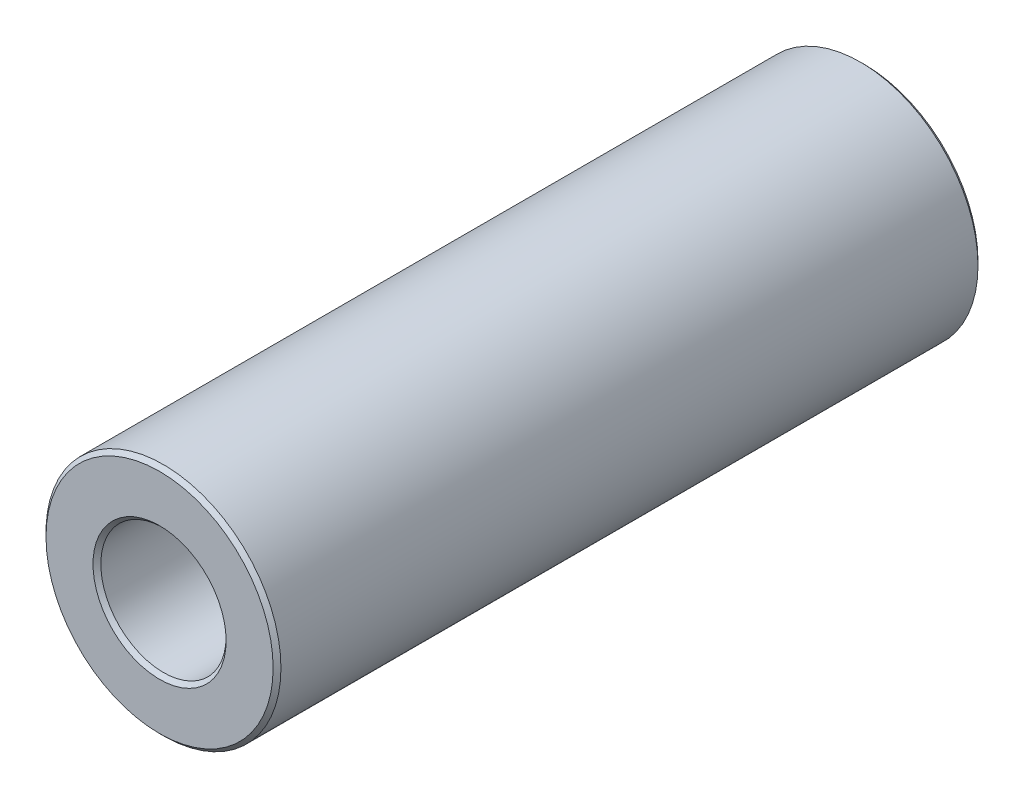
from build123d import *

# Parameters (mm, degrees)
SKETCH1_R           = 3
SKETCH1_R_2         = 1.6
BOSS_EXTRUDE2_DEPTH = 9
CHAMFER3_SIZE       = 0.1


with BuildPart() as part:
    # Sketch1 → Boss-Extrude2 (new, symmetric)
    with BuildSketch(Plane.XY):
        Circle(SKETCH1_R)
        Circle(SKETCH1_R_2, mode=Mode.SUBTRACT)
    extrude(amount=BOSS_EXTRUDE2_DEPTH, both=True)

    # Chamfer3
    chamfer3_edges = [part.edges().sort_by_distance(p)[0] for p in [
        (-3, 0, -9),
        (-3, 0, 9),
        (-1.6, 0, -9),
        (-1.6, 0, 9),
    ]]
    chamfer(chamfer3_edges, length=CHAMFER3_SIZE)


solid = part.part
